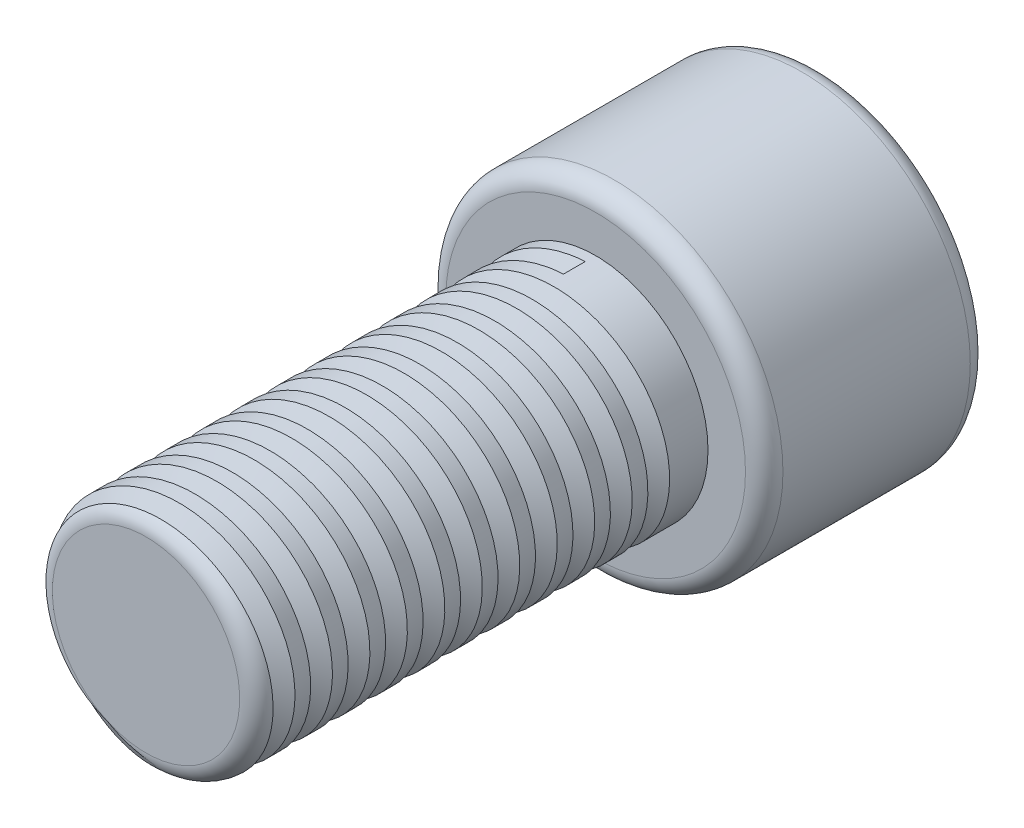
from build123d import *

# Parameters (mm, degrees)
SKETCH_1_R          = 4.5
EXTRUDE_1_DEPTH     = 6
SKETCH_2_R          = 3
EXTRUDE_2_DEPTH     = 12
CUT_EXTRUDE_1_DEPTH = 5
FILLET_1_R          = 0.5
SWEEP_1_PITCH       = 1
SWEEP_1_HEIGHT      = 12
SWEEP_1_RADIUS      = 2.5
SWEEP_1_START_ANGLE = 90


with BuildPart() as part:
    # Sketch 1 → Extrude 1 (new body)
    with BuildSketch(Plane.XY):
        Circle(SKETCH_1_R)
    extrude(amount=EXTRUDE_1_DEPTH)

    # Sketch 2 → Extrude 2 (add)
    with BuildSketch(Plane.XY.offset(6)):
        Circle(SKETCH_2_R)
    extrude(amount=EXTRUDE_2_DEPTH)

    # Sketch 3 → Cut-Extrude 1 (cut)
    with BuildSketch(Plane(origin=(0, 0, 0), x_dir=(-1, 0, 0), z_dir=(0, 0, -1))):
        Polygon((2.886751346, 0), (1.443375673, 2.5), (-1.443375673, 2.5), (-2.886751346, 0), (-1.443375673, -2.5), (1.443375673, -2.5), align=None)
    extrude(amount=-CUT_EXTRUDE_1_DEPTH, mode=Mode.SUBTRACT)

    # Fillet 1
    fillet_1_edges = [part.edges().sort_by_distance(p)[0] for p in [
        (-4.5, 0, 0),
        (-4.5, 0, 6),
        (-3, 0, 18),
    ]]
    fillet(fillet_1_edges, radius=FILLET_1_R)

    # Sweep 1: sweep along a helix
    with BuildLine() as sweep_1_path:
        add(Helix(SWEEP_1_PITCH, SWEEP_1_HEIGHT, SWEEP_1_RADIUS, center=(0, 0, 18), direction=(0, 0, -1), mode=Mode.PRIVATE).rotate(Axis((0, 0, 18), (0, 0, -1)), SWEEP_1_START_ANGLE))
    # Sketch 5 → Sweep 1 (sweep, cut)
    with BuildSketch(Plane(origin=(0, 0, 0), x_dir=(1, 0, 0), z_dir=(0, 1, 0))):
        Polygon((2.497170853, -18.318758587), (3.080110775, -18.655319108), (3.080110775, -17.982198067), align=None)
    sweep(path=sweep_1_path.line, is_frenet=True, mode=Mode.SUBTRACT)


solid = part.part
